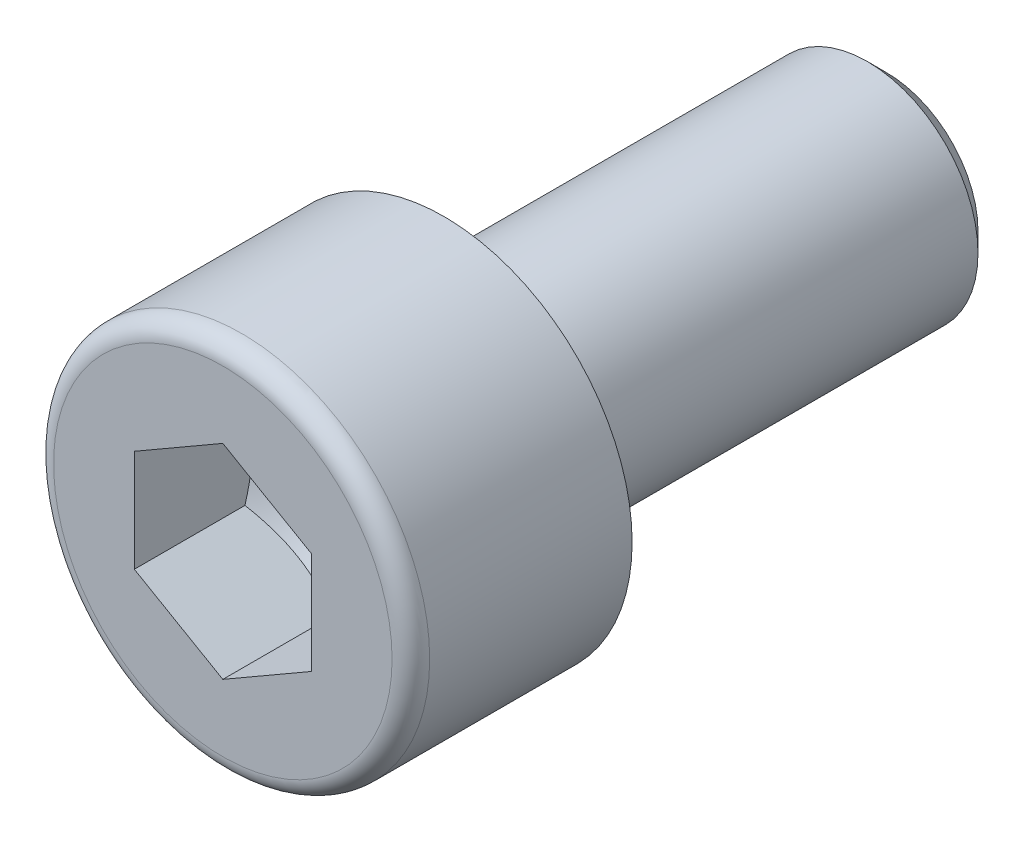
ISO-10303-21;
HEADER;
FILE_DESCRIPTION(('STEP AP214'),'2;1');
FILE_NAME('part.step','',(''),(''),'','','');
FILE_SCHEMA(('AUTOMOTIVE_DESIGN { 1 0 10303 214 1 1 1 1 }'));
ENDSEC;
DATA;
#1=APPLICATION_CONTEXT('core data for automotive mechanical design processes');
#2=APPLICATION_PROTOCOL_DEFINITION('international standard','automotive_design',2000,#1);
#3=PRODUCT_CONTEXT('',#1,'mechanical');
#4=PRODUCT('Part','Part','',(#3));
#5=PRODUCT_RELATED_PRODUCT_CATEGORY('part','',(#4));
#6=PRODUCT_DEFINITION_FORMATION('','',#4);
#7=PRODUCT_DEFINITION_CONTEXT('part definition',#1,'design');
#8=PRODUCT_DEFINITION('design','',#6,#7);
#9=PRODUCT_DEFINITION_SHAPE('','',#8);
#10=(LENGTH_UNIT() NAMED_UNIT(*) SI_UNIT(.MILLI.,.METRE.));
#11=(NAMED_UNIT(*) PLANE_ANGLE_UNIT() SI_UNIT($,.RADIAN.));
#12=(NAMED_UNIT(*) SI_UNIT($,.STERADIAN.) SOLID_ANGLE_UNIT());
#13=UNCERTAINTY_MEASURE_WITH_UNIT(LENGTH_MEASURE(1.E-05),#10,'distance_accuracy_value','');
#14=(GEOMETRIC_REPRESENTATION_CONTEXT(3) GLOBAL_UNCERTAINTY_ASSIGNED_CONTEXT((#13)) GLOBAL_UNIT_ASSIGNED_CONTEXT((#10,
#11,#12)) REPRESENTATION_CONTEXT('',''));
#15=CARTESIAN_POINT('',(0.,0.,0.));
#16=DIRECTION('',(0.,0.,1.));
#17=DIRECTION('',(1.,0.,0.));
#18=AXIS2_PLACEMENT_3D('',#15,#16,#17);
#19=CARTESIAN_POINT('',(0.,0.,5.));
#20=DIRECTION('',(0.,0.,1.));
#21=DIRECTION('',(1.,0.,0.));
#22=AXIS2_PLACEMENT_3D('',#19,#20,#21);
#23=PLANE('',#22);
#24=CARTESIAN_POINT('',(0.,0.,5.));
#25=DIRECTION('',(0.,0.,1.));
#26=DIRECTION('',(1.,0.,0.));
#27=AXIS2_PLACEMENT_3D('',#24,#25,#26);
#28=CIRCLE('',#27,3.825);
#29=CARTESIAN_POINT('',(3.825,0.,5.));
#30=VERTEX_POINT('',#29);
#31=EDGE_CURVE('E10',#30,#30,#28,.T.);
#32=ORIENTED_EDGE('',*,*,#31,.T.);
#33=EDGE_LOOP('',(#32));
#34=FACE_BOUND('',#33,.T.);
#35=DIRECTION('',(0.,-1.,0.));
#36=VECTOR('',#35,1.);
#37=CARTESIAN_POINT('',(1.99999906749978,1.1547,5.));
#38=LINE('',#37,#36);
#39=CARTESIAN_POINT('',(1.99999906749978,1.1547,5.));
#40=VERTEX_POINT('',#39);
#41=CARTESIAN_POINT('',(1.99999906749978,-1.1547,5.));
#42=VERTEX_POINT('',#41);
#43=EDGE_CURVE('E91',#40,#42,#38,.T.);
#44=ORIENTED_EDGE('',*,*,#43,.T.);
#45=DIRECTION('',(-0.866025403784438,-0.5,0.));
#46=VECTOR('',#45,1.);
#47=CARTESIAN_POINT('',(1.99999906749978,-1.1547,5.));
#48=LINE('',#47,#46);
#49=CARTESIAN_POINT('',(0.,-2.3094,5.));
#50=VERTEX_POINT('',#49);
#51=EDGE_CURVE('E30',#42,#50,#48,.T.);
#52=ORIENTED_EDGE('',*,*,#51,.T.);
#53=DIRECTION('',(-0.866025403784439,0.5,0.));
#54=VECTOR('',#53,1.);
#55=CARTESIAN_POINT('',(0.,-2.3094,5.));
#56=LINE('',#55,#54);
#57=CARTESIAN_POINT('',(-1.99999906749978,-1.1547,5.));
#58=VERTEX_POINT('',#57);
#59=EDGE_CURVE('E168',#50,#58,#56,.T.);
#60=ORIENTED_EDGE('',*,*,#59,.T.);
#61=DIRECTION('',(0.,1.,0.));
#62=VECTOR('',#61,1.);
#63=CARTESIAN_POINT('',(-1.99999906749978,-1.1547,5.));
#64=LINE('',#63,#62);
#65=CARTESIAN_POINT('',(-1.99999906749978,1.1547,5.));
#66=VERTEX_POINT('',#65);
#67=EDGE_CURVE('E164',#58,#66,#64,.T.);
#68=ORIENTED_EDGE('',*,*,#67,.T.);
#69=DIRECTION('',(0.866025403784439,0.5,0.));
#70=VECTOR('',#69,1.);
#71=CARTESIAN_POINT('',(-1.99999906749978,1.1547,5.));
#72=LINE('',#71,#70);
#73=CARTESIAN_POINT('',(0.,2.3094,5.));
#74=VERTEX_POINT('',#73);
#75=EDGE_CURVE('E159',#66,#74,#72,.T.);
#76=ORIENTED_EDGE('',*,*,#75,.T.);
#77=DIRECTION('',(0.866025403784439,-0.5,0.));
#78=VECTOR('',#77,1.);
#79=CARTESIAN_POINT('',(0.,2.3094,5.));
#80=LINE('',#79,#78);
#81=EDGE_CURVE('E95',#74,#40,#80,.T.);
#82=ORIENTED_EDGE('',*,*,#81,.T.);
#83=EDGE_LOOP('',(#44,#52,#60,#68,#76,#82));
#84=FACE_BOUND('',#83,.T.);
#85=ADVANCED_FACE('F16',(#34,#84),#23,.T.);
#86=CARTESIAN_POINT('',(0.,0.,4.575));
#87=DIRECTION('',(0.,0.,1.));
#88=DIRECTION('',(1.,0.,0.));
#89=AXIS2_PLACEMENT_3D('',#86,#87,#88);
#90=TOROIDAL_SURFACE('',#89,3.825,0.425);
#91=ORIENTED_EDGE('',*,*,#31,.F.);
#92=EDGE_LOOP('',(#91));
#93=FACE_BOUND('',#92,.T.);
#94=CARTESIAN_POINT('',(0.,0.,4.575));
#95=DIRECTION('',(0.,0.,1.));
#96=DIRECTION('',(1.,0.,0.));
#97=AXIS2_PLACEMENT_3D('',#94,#95,#96);
#98=CIRCLE('',#97,4.25);
#99=CARTESIAN_POINT('',(4.25,0.,4.575));
#100=VERTEX_POINT('',#99);
#101=EDGE_CURVE('E23',#100,#100,#98,.T.);
#102=ORIENTED_EDGE('',*,*,#101,.T.);
#103=EDGE_LOOP('',(#102));
#104=FACE_BOUND('',#103,.T.);
#105=ADVANCED_FACE('F132',(#93,#104),#90,.T.);
#106=CARTESIAN_POINT('',(0.,0.,5.));
#107=DIRECTION('',(0.,0.,1.));
#108=DIRECTION('',(1.,0.,0.));
#109=AXIS2_PLACEMENT_3D('',#106,#107,#108);
#110=CYLINDRICAL_SURFACE('',#109,4.25);
#111=CARTESIAN_POINT('',(0.,0.,0.));
#112=DIRECTION('',(0.,0.,1.));
#113=DIRECTION('',(1.,0.,0.));
#114=AXIS2_PLACEMENT_3D('',#111,#112,#113);
#115=CIRCLE('',#114,4.25);
#116=CARTESIAN_POINT('',(4.25,0.,0.));
#117=VERTEX_POINT('',#116);
#118=EDGE_CURVE('E127',#117,#117,#115,.T.);
#119=ORIENTED_EDGE('',*,*,#118,.T.);
#120=EDGE_LOOP('',(#119));
#121=FACE_BOUND('',#120,.T.);
#122=ORIENTED_EDGE('',*,*,#101,.F.);
#123=EDGE_LOOP('',(#122));
#124=FACE_BOUND('',#123,.T.);
#125=ADVANCED_FACE('F134',(#121,#124),#110,.T.);
#126=CARTESIAN_POINT('',(0.,4.25,0.));
#127=DIRECTION('',(0.,0.,-1.));
#128=DIRECTION('',(-1.,0.,0.));
#129=AXIS2_PLACEMENT_3D('',#126,#127,#128);
#130=PLANE('',#129);
#131=CARTESIAN_POINT('',(0.,0.,0.));
#132=DIRECTION('',(0.,0.,1.));
#133=DIRECTION('',(1.,0.,0.));
#134=AXIS2_PLACEMENT_3D('',#131,#132,#133);
#135=CIRCLE('',#134,2.75);
#136=CARTESIAN_POINT('',(2.75,0.,0.));
#137=VERTEX_POINT('',#136);
#138=EDGE_CURVE('E124',#137,#137,#135,.T.);
#139=ORIENTED_EDGE('',*,*,#138,.T.);
#140=EDGE_LOOP('',(#139));
#141=FACE_BOUND('',#140,.T.);
#142=ORIENTED_EDGE('',*,*,#118,.F.);
#143=EDGE_LOOP('',(#142));
#144=FACE_BOUND('',#143,.T.);
#145=ADVANCED_FACE('F136',(#141,#144),#130,.T.);
#146=CARTESIAN_POINT('',(0.,0.,-0.25));
#147=DIRECTION('',(0.,0.,1.));
#148=DIRECTION('',(1.,0.,0.));
#149=AXIS2_PLACEMENT_3D('',#146,#147,#148);
#150=TOROIDAL_SURFACE('',#149,2.75,0.25);
#151=CARTESIAN_POINT('',(0.,0.,-0.25));
#152=DIRECTION('',(0.,0.,1.));
#153=DIRECTION('',(1.,0.,0.));
#154=AXIS2_PLACEMENT_3D('',#151,#152,#153);
#155=CIRCLE('',#154,2.5);
#156=CARTESIAN_POINT('',(2.5,0.,-0.25));
#157=VERTEX_POINT('',#156);
#158=EDGE_CURVE('E121',#157,#157,#155,.T.);
#159=ORIENTED_EDGE('',*,*,#158,.T.);
#160=EDGE_LOOP('',(#159));
#161=FACE_BOUND('',#160,.T.);
#162=ORIENTED_EDGE('',*,*,#138,.F.);
#163=EDGE_LOOP('',(#162));
#164=FACE_BOUND('',#163,.T.);
#165=ADVANCED_FACE('F144',(#161,#164),#150,.F.);
#166=CARTESIAN_POINT('',(0.,0.,5.));
#167=DIRECTION('',(0.,0.,1.));
#168=DIRECTION('',(1.,0.,0.));
#169=AXIS2_PLACEMENT_3D('',#166,#167,#168);
#170=CYLINDRICAL_SURFACE('',#169,2.5);
#171=CARTESIAN_POINT('',(0.,0.,-0.251));
#172=DIRECTION('',(0.,0.,1.));
#173=DIRECTION('',(1.,0.,0.));
#174=AXIS2_PLACEMENT_3D('',#171,#172,#173);
#175=CIRCLE('',#174,2.5);
#176=CARTESIAN_POINT('',(2.5,0.,-0.251));
#177=VERTEX_POINT('',#176);
#178=EDGE_CURVE('E118',#177,#177,#175,.T.);
#179=ORIENTED_EDGE('',*,*,#178,.T.);
#180=EDGE_LOOP('',(#179));
#181=FACE_BOUND('',#180,.T.);
#182=ORIENTED_EDGE('',*,*,#158,.F.);
#183=EDGE_LOOP('',(#182));
#184=FACE_BOUND('',#183,.T.);
#185=ADVANCED_FACE('F311',(#181,#184),#170,.T.);
#186=CARTESIAN_POINT('',(0.,0.,-0.251));
#187=DIRECTION('',(0.,0.,1.));
#188=DIRECTION('',(1.,0.,0.));
#189=AXIS2_PLACEMENT_3D('',#186,#187,#188);
#190=CONICAL_SURFACE('',#189,2.5,0.524755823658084);
#191=CARTESIAN_POINT('',(0.,0.,-0.998977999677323));
#192=DIRECTION('',(0.,0.,1.));
#193=DIRECTION('',(1.,0.,0.));
#194=AXIS2_PLACEMENT_3D('',#191,#192,#193);
#195=CIRCLE('',#194,2.067);
#196=CARTESIAN_POINT('',(2.067,0.,-0.998977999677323));
#197=VERTEX_POINT('',#196);
#198=EDGE_CURVE('E115',#197,#197,#195,.T.);
#199=ORIENTED_EDGE('',*,*,#198,.T.);
#200=EDGE_LOOP('',(#199));
#201=FACE_BOUND('',#200,.T.);
#202=ORIENTED_EDGE('',*,*,#178,.F.);
#203=EDGE_LOOP('',(#202));
#204=FACE_BOUND('',#203,.T.);
#205=ADVANCED_FACE('F303',(#201,#204),#190,.T.);
#206=CARTESIAN_POINT('',(0.,2.067,-0.998977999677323));
#207=DIRECTION('',(0.,0.,1.));
#208=DIRECTION('',(1.,0.,0.));
#209=AXIS2_PLACEMENT_3D('',#206,#207,#208);
#210=PLANE('',#209);
#211=CARTESIAN_POINT('',(0.,0.,-0.998977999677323));
#212=DIRECTION('',(0.,0.,1.));
#213=DIRECTION('',(1.,0.,0.));
#214=AXIS2_PLACEMENT_3D('',#211,#212,#213);
#215=CIRCLE('',#214,2.5);
#216=CARTESIAN_POINT('',(2.5,0.,-0.998977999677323));
#217=VERTEX_POINT('',#216);
#218=EDGE_CURVE('E112',#217,#217,#215,.T.);
#219=ORIENTED_EDGE('',*,*,#218,.T.);
#220=EDGE_LOOP('',(#219));
#221=FACE_BOUND('',#220,.T.);
#222=ORIENTED_EDGE('',*,*,#198,.F.);
#223=EDGE_LOOP('',(#222));
#224=FACE_BOUND('',#223,.T.);
#225=ADVANCED_FACE('F295',(#221,#224),#210,.T.);
#226=CARTESIAN_POINT('',(0.,0.,5.));
#227=DIRECTION('',(0.,0.,1.));
#228=DIRECTION('',(1.,0.,0.));
#229=AXIS2_PLACEMENT_3D('',#226,#227,#228);
#230=CYLINDRICAL_SURFACE('',#229,2.5);
#231=CARTESIAN_POINT('',(0.,0.,-9.567));
#232=DIRECTION('',(0.,0.,1.));
#233=DIRECTION('',(1.,0.,0.));
#234=AXIS2_PLACEMENT_3D('',#231,#232,#233);
#235=CIRCLE('',#234,2.5);
#236=CARTESIAN_POINT('',(2.5,0.,-9.567));
#237=VERTEX_POINT('',#236);
#238=EDGE_CURVE('E109',#237,#237,#235,.T.);
#239=ORIENTED_EDGE('',*,*,#238,.T.);
#240=EDGE_LOOP('',(#239));
#241=FACE_BOUND('',#240,.T.);
#242=ORIENTED_EDGE('',*,*,#218,.F.);
#243=EDGE_LOOP('',(#242));
#244=FACE_BOUND('',#243,.T.);
#245=ADVANCED_FACE('F287',(#241,#244),#230,.T.);
#246=CARTESIAN_POINT('',(0.,0.,-9.567));
#247=DIRECTION('',(0.,0.,1.));
#248=DIRECTION('',(1.,0.,0.));
#249=AXIS2_PLACEMENT_3D('',#246,#247,#248);
#250=CONICAL_SURFACE('',#249,2.5,0.785398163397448);
#251=CARTESIAN_POINT('',(0.,0.,-10.));
#252=DIRECTION('',(0.,0.,1.));
#253=DIRECTION('',(1.,0.,0.));
#254=AXIS2_PLACEMENT_3D('',#251,#252,#253);
#255=CIRCLE('',#254,2.067);
#256=CARTESIAN_POINT('',(2.067,0.,-10.));
#257=VERTEX_POINT('',#256);
#258=EDGE_CURVE('E106',#257,#257,#255,.T.);
#259=ORIENTED_EDGE('',*,*,#258,.T.);
#260=EDGE_LOOP('',(#259));
#261=FACE_BOUND('',#260,.T.);
#262=ORIENTED_EDGE('',*,*,#238,.F.);
#263=EDGE_LOOP('',(#262));
#264=FACE_BOUND('',#263,.T.);
#265=ADVANCED_FACE('F280',(#261,#264),#250,.T.);
#266=CARTESIAN_POINT('',(0.,2.067,-10.));
#267=DIRECTION('',(0.,0.,-1.));
#268=DIRECTION('',(-1.,0.,0.));
#269=AXIS2_PLACEMENT_3D('',#266,#267,#268);
#270=PLANE('',#269);
#271=ORIENTED_EDGE('',*,*,#258,.F.);
#272=EDGE_LOOP('',(#271));
#273=FACE_BOUND('',#272,.T.);
#274=ADVANCED_FACE('F224',(#273),#270,.T.);
#275=CARTESIAN_POINT('',(1.99999906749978,-1.1547,1.16666728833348));
#276=DIRECTION('',(-0.5,0.866025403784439,0.));
#277=DIRECTION('',(0.866025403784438,0.5,0.));
#278=AXIS2_PLACEMENT_3D('',#275,#276,#277);
#279=PLANE('',#278);
#280=DIRECTION('',(0.,0.,1.));
#281=VECTOR('',#280,1.);
#282=CARTESIAN_POINT('',(0.,-2.3094,1.16666728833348));
#283=LINE('',#282,#281);
#284=CARTESIAN_POINT('',(0.,-2.3094,2.5));
#285=VERTEX_POINT('',#284);
#286=EDGE_CURVE('E104',#285,#50,#283,.T.);
#287=ORIENTED_EDGE('',*,*,#286,.T.);
#288=ORIENTED_EDGE('',*,*,#51,.F.);
#289=DIRECTION('',(0.,0.,1.));
#290=VECTOR('',#289,1.);
#291=CARTESIAN_POINT('',(1.99999906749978,-1.1547,1.16666728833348));
#292=LINE('',#291,#290);
#293=CARTESIAN_POINT('',(1.99999906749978,-1.1547,2.5));
#294=VERTEX_POINT('',#293);
#295=EDGE_CURVE('E85',#294,#42,#292,.T.);
#296=ORIENTED_EDGE('',*,*,#295,.F.);
#297=CARTESIAN_POINT('',(-1.99999999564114E-07,-2.30940011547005,2.50000006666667));
#298=CARTESIAN_POINT('',(0.0878876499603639,-2.25865804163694,2.47069561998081));
#299=CARTESIAN_POINT('',(0.176534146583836,-2.20747796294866,2.44404475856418));
#300=CARTESIAN_POINT('',(0.355361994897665,-2.10423165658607,2.39752647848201));
#301=CARTESIAN_POINT('',(0.445546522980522,-2.0521635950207,2.37767551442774));
#302=CARTESIAN_POINT('',(0.624797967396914,-1.94867272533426,2.34677605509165));
#303=CARTESIAN_POINT('',(0.713837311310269,-1.89726583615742,2.33552188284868));
#304=CARTESIAN_POINT('',(0.892334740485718,-1.79421029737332,2.32208925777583));
#305=CARTESIAN_POINT('',(0.981792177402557,-1.74256202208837,2.31989967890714));
#306=CARTESIAN_POINT('',(1.14893382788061,-1.64606274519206,2.32446636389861));
#307=CARTESIAN_POINT('',(1.2266431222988,-1.60119726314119,2.33010135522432));
#308=CARTESIAN_POINT('',(1.38155546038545,-1.51175858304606,2.34795736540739));
#309=CARTESIAN_POINT('',(1.45875796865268,-1.46718569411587,2.36018447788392));
#310=CARTESIAN_POINT('',(1.61398944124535,-1.37756276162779,2.39074989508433));
#311=CARTESIAN_POINT('',(1.69199876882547,-1.3325240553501,2.40921770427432));
#312=CARTESIAN_POINT('',(1.84685425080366,-1.2431182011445,2.45113182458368));
#313=CARTESIAN_POINT('',(1.92370238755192,-1.19874990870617,2.47456829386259));
#314=CARTESIAN_POINT('',(1.99999926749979,-1.15469988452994,2.50000006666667));
#315=B_SPLINE_CURVE_WITH_KNOTS('',3,(#297,#298,#299,#300,#301,#302,#303,#304,#305,#306,#307,
#308,#309,#310,#311,#312,#313,#314),.UNSPECIFIED.,.F.,.F.,(4,2,2,2,2,2,2,2,4),(0.,
0.317015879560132,0.634793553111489,0.944707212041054,1.25424036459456,1.52370723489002,
1.79342362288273,2.06912103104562,2.3442773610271),.UNSPECIFIED.);
#316=EDGE_CURVE('E78',#285,#294,#315,.T.);
#317=ORIENTED_EDGE('',*,*,#316,.F.);
#318=EDGE_LOOP('',(#287,#288,#296,#317));
#319=FACE_BOUND('',#318,.T.);
#320=ADVANCED_FACE('F86',(#319),#279,.T.);
#321=CARTESIAN_POINT('',(0.,-2.3094,1.16666728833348));
#322=DIRECTION('',(0.5,0.866025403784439,0.));
#323=DIRECTION('',(0.866025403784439,-0.5,0.));
#324=AXIS2_PLACEMENT_3D('',#321,#322,#323);
#325=PLANE('',#324);
#326=DIRECTION('',(0.,0.,1.));
#327=VECTOR('',#326,1.);
#328=CARTESIAN_POINT('',(-1.99999906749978,-1.1547,1.16666728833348));
#329=LINE('',#328,#327);
#330=CARTESIAN_POINT('',(-1.99999906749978,-1.1547,2.5));
#331=VERTEX_POINT('',#330);
#332=EDGE_CURVE('E102',#331,#58,#329,.T.);
#333=ORIENTED_EDGE('',*,*,#332,.T.);
#334=ORIENTED_EDGE('',*,*,#59,.F.);
#335=ORIENTED_EDGE('',*,*,#286,.F.);
#336=CARTESIAN_POINT('',(-1.99999926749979,-1.15469988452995,2.50000006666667));
#337=CARTESIAN_POINT('',(-1.91211141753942,-1.20544195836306,2.47069561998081));
#338=CARTESIAN_POINT('',(-1.82346492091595,-1.25662203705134,2.44404475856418));
#339=CARTESIAN_POINT('',(-1.64463707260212,-1.35986834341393,2.39752647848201));
#340=CARTESIAN_POINT('',(-1.55445254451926,-1.41193640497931,2.37767551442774));
#341=CARTESIAN_POINT('',(-1.37520110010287,-1.51542727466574,2.34677605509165));
#342=CARTESIAN_POINT('',(-1.28616175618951,-1.56683416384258,2.33552188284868));
#343=CARTESIAN_POINT('',(-1.10766432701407,-1.66988970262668,2.32208925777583));
#344=CARTESIAN_POINT('',(-1.01820689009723,-1.72153797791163,2.31989967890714));
#345=CARTESIAN_POINT('',(-0.851065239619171,-1.81803725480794,2.32446636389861));
#346=CARTESIAN_POINT('',(-0.773355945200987,-1.86290273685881,2.33010135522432));
#347=CARTESIAN_POINT('',(-0.618443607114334,-1.95234141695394,2.34795736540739));
#348=CARTESIAN_POINT('',(-0.541241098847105,-1.99691430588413,2.36018447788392));
#349=CARTESIAN_POINT('',(-0.386009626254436,-2.08653723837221,2.39074989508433));
#350=CARTESIAN_POINT('',(-0.30800029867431,-2.1315759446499,2.40921770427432));
#351=CARTESIAN_POINT('',(-0.153144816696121,-2.2209817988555,2.45113182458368));
#352=CARTESIAN_POINT('',(-0.0762966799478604,-2.26535009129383,2.47456829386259));
#353=CARTESIAN_POINT('',(2.00000000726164E-07,-2.30940011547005,2.50000006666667));
#354=B_SPLINE_CURVE_WITH_KNOTS('',3,(#336,#337,#338,#339,#340,#341,#342,#343,#344,#345,#346,
#347,#348,#349,#350,#351,#352,#353),.UNSPECIFIED.,.F.,.F.,(4,2,2,2,2,2,2,2,4),(0.,
0.317015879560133,0.63479355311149,0.944707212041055,1.25424036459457,1.52370723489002,
1.79342362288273,2.06912103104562,2.3442773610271),.UNSPECIFIED.);
#355=EDGE_CURVE('E82',#331,#285,#354,.T.);
#356=ORIENTED_EDGE('',*,*,#355,.F.);
#357=EDGE_LOOP('',(#333,#334,#335,#356));
#358=FACE_BOUND('',#357,.T.);
#359=ADVANCED_FACE('F215',(#358),#325,.T.);
#360=CARTESIAN_POINT('',(-1.99999906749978,-1.1547,1.16666728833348));
#361=DIRECTION('',(1.,0.,0.));
#362=DIRECTION('',(0.,-1.,0.));
#363=AXIS2_PLACEMENT_3D('',#360,#361,#362);
#364=PLANE('',#363);
#365=DIRECTION('',(0.,0.,1.));
#366=VECTOR('',#365,1.);
#367=CARTESIAN_POINT('',(-1.99999906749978,1.1547,1.16666728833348));
#368=LINE('',#367,#366);
#369=CARTESIAN_POINT('',(-1.99999906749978,1.1547,2.5));
#370=VERTEX_POINT('',#369);
#371=EDGE_CURVE('E100',#370,#66,#368,.T.);
#372=ORIENTED_EDGE('',*,*,#371,.T.);
#373=ORIENTED_EDGE('',*,*,#67,.F.);
#374=ORIENTED_EDGE('',*,*,#332,.F.);
#375=CARTESIAN_POINT('',(-1.99999906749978,-2.99028884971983,3.24367023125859));
#376=CARTESIAN_POINT('',(-1.99999906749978,-2.90392200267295,3.20223468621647));
#377=CARTESIAN_POINT('',(-1.99999906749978,-2.81734475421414,3.16122952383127));
#378=CARTESIAN_POINT('',(-1.99999906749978,-2.64365731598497,3.08032411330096));
#379=CARTESIAN_POINT('',(-1.99999906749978,-2.55654703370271,3.04042406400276));
#380=CARTESIAN_POINT('',(-1.99999906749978,-2.38118192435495,2.96175012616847));
#381=CARTESIAN_POINT('',(-1.99999906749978,-2.29292335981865,2.92298453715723));
#382=CARTESIAN_POINT('',(-1.99999906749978,-2.11566562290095,2.84719170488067));
#383=CARTESIAN_POINT('',(-1.99999906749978,-2.02666648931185,2.81016437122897));
#384=CARTESIAN_POINT('',(-1.99999906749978,-1.84544164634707,2.73736806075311));
#385=CARTESIAN_POINT('',(-1.99999906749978,-1.75319241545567,2.70165729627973));
#386=CARTESIAN_POINT('',(-1.99999906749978,-1.56757813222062,2.63320478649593));
#387=CARTESIAN_POINT('',(-1.99999906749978,-1.47421295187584,2.60046338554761));
#388=CARTESIAN_POINT('',(-1.99999906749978,-1.28643386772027,2.53888591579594));
#389=CARTESIAN_POINT('',(-1.99999906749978,-1.19202295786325,2.51004081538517));
#390=CARTESIAN_POINT('',(-1.99999906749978,-1.00184812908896,2.45724234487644));
#391=CARTESIAN_POINT('',(-1.99999906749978,-0.906084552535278,2.43328775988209));
#392=CARTESIAN_POINT('',(-1.99999906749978,-0.713403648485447,2.39154750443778));
#393=CARTESIAN_POINT('',(-1.99999906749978,-0.616489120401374,2.37374916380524));
#394=CARTESIAN_POINT('',(-1.99999906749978,-0.42157646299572,2.34548602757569));
#395=CARTESIAN_POINT('',(-1.99999906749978,-0.323578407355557,2.33502073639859));
#396=CARTESIAN_POINT('',(-1.99999906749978,-0.128212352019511,2.32239776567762));
#397=CARTESIAN_POINT('',(-1.99999906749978,-0.030850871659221,2.32014205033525));
#398=CARTESIAN_POINT('',(-1.99999906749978,0.163710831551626,2.32386608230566));
#399=CARTESIAN_POINT('',(-1.99999906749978,0.26091104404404,2.32984633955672));
#400=CARTESIAN_POINT('',(-1.99999906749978,0.500738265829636,2.35423686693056));
#401=CARTESIAN_POINT('',(-1.99999906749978,0.64290057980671,2.3772180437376));
#402=CARTESIAN_POINT('',(-1.99999906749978,0.924460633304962,2.43647980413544));
#403=CARTESIAN_POINT('',(-1.99999906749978,1.06385482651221,2.47277641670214));
#404=CARTESIAN_POINT('',(-1.99999906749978,1.27233418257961,2.53477991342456));
#405=CARTESIAN_POINT('',(-1.99999906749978,1.3424969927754,2.55699669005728));
#406=CARTESIAN_POINT('',(-1.99999906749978,1.4820922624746,2.60348542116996));
#407=CARTESIAN_POINT('',(-1.99999906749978,1.55152514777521,2.62775609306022));
#408=CARTESIAN_POINT('',(-1.99999906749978,1.68975335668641,2.67800013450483));
#409=CARTESIAN_POINT('',(-1.99999906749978,1.75854879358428,2.7039731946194));
#410=CARTESIAN_POINT('',(-1.99999906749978,1.8955975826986,2.75734107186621));
#411=CARTESIAN_POINT('',(-1.99999906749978,1.96385084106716,2.78473612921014));
#412=CARTESIAN_POINT('',(-1.99999906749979,2.13806939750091,2.8564177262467));
#413=CARTESIAN_POINT('',(-1.99999906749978,2.24368634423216,2.90155001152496));
#414=CARTESIAN_POINT('',(-1.99999906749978,2.45396648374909,2.99399021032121));
#415=CARTESIAN_POINT('',(-1.99999906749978,2.55862960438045,3.04129828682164));
#416=CARTESIAN_POINT('',(-1.99999906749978,2.87150603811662,3.18571921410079));
#417=CARTESIAN_POINT('',(-1.99999906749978,3.07857147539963,3.28531395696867));
#418=CARTESIAN_POINT('',(-1.99999906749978,3.49093332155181,3.4886804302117));
#419=CARTESIAN_POINT('',(-1.99999906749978,3.69622724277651,3.59245714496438));
#420=CARTESIAN_POINT('',(-1.99999906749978,4.10540852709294,3.80267901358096));
#421=CARTESIAN_POINT('',(-1.99999906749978,4.30929606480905,3.90912382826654));
#422=CARTESIAN_POINT('',(-1.99999906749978,4.69689950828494,4.11371795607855));
#423=CARTESIAN_POINT('',(-1.99999906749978,4.8807029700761,4.21170196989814));
#424=CARTESIAN_POINT('',(-1.99999906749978,5.24771864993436,4.40878643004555));
#425=CARTESIAN_POINT('',(-1.99999906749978,5.43093084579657,4.50788691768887));
#426=CARTESIAN_POINT('',(-1.99999906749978,5.79643429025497,4.70667121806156));
#427=CARTESIAN_POINT('',(-1.99999906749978,5.97872669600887,4.80635290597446));
#428=CARTESIAN_POINT('',(-1.99999906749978,6.34294295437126,5.00636506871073));
#429=CARTESIAN_POINT('',(-1.99999906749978,6.52486682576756,5.10669550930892));
#430=CARTESIAN_POINT('',(-1.99999906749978,6.70665829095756,5.20726384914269));
#431=B_SPLINE_CURVE_WITH_KNOTS('',3,(#375,#376,#377,#378,#379,#380,#381,#382,#383,#384,#385,
#386,#387,#388,#389,#390,#391,#392,#393,#394,#395,#396,#397,#398,#399,#400,#401,#402,#403,#404,
#405,#406,#407,#408,#409,#410,#411,#412,#413,#414,#415,#416,#417,#418,#419,#420,#421,#422,#423,
#424,#425,#426,#427,#428,#429,#430),.UNSPECIFIED.,.F.,.F.,(4,2,2,2,2,2,2,2,2,2,2,2,2,2,2,2,2,2,
2,2,2,2,2,2,2,2,2,4),(0.,0.287380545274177,0.574812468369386,0.86398796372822,1.15314840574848,
1.44986914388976,1.746624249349,2.04267922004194,2.33866055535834,2.63402905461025,
2.92937759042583,3.22118738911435,3.51301525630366,3.94415234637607,4.37581014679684,
4.59657452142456,4.81720203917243,5.03778956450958,5.25841447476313,5.6029464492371,
5.94750427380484,6.63673372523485,7.32681046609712,8.01679992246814,8.64166451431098,
9.26655230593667,9.88985069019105,10.5131164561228),.UNSPECIFIED.);
#432=EDGE_CURVE('E206',#370,#331,#431,.F.);
#433=ORIENTED_EDGE('',*,*,#432,.F.);
#434=EDGE_LOOP('',(#372,#373,#374,#433));
#435=FACE_BOUND('',#434,.T.);
#436=ADVANCED_FACE('F211',(#435),#364,.T.);
#437=CARTESIAN_POINT('',(-1.99999906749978,1.1547,1.16666728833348));
#438=DIRECTION('',(0.5,-0.866025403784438,0.));
#439=DIRECTION('',(-0.866025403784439,-0.5,0.));
#440=AXIS2_PLACEMENT_3D('',#437,#438,#439);
#441=PLANE('',#440);
#442=DIRECTION('',(0.,0.,1.));
#443=VECTOR('',#442,1.);
#444=CARTESIAN_POINT('',(0.,2.3094,1.16666728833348));
#445=LINE('',#444,#443);
#446=CARTESIAN_POINT('',(0.,2.3094,2.5));
#447=VERTEX_POINT('',#446);
#448=EDGE_CURVE('E93',#447,#74,#445,.T.);
#449=ORIENTED_EDGE('',*,*,#448,.T.);
#450=ORIENTED_EDGE('',*,*,#75,.F.);
#451=ORIENTED_EDGE('',*,*,#371,.F.);
#452=CARTESIAN_POINT('',(2.00000000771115E-07,2.30940011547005,2.50000006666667));
#453=CARTESIAN_POINT('',(-0.0878876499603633,2.25865804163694,2.47069561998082));
#454=CARTESIAN_POINT('',(-0.176534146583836,2.20747796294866,2.44404475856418));
#455=CARTESIAN_POINT('',(-0.355361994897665,2.10423165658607,2.39752647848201));
#456=CARTESIAN_POINT('',(-0.445546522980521,2.0521635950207,2.37767551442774));
#457=CARTESIAN_POINT('',(-0.624797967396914,1.94867272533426,2.34677605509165));
#458=CARTESIAN_POINT('',(-0.713837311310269,1.89726583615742,2.33552188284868));
#459=CARTESIAN_POINT('',(-0.892334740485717,1.79421029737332,2.32208925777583));
#460=CARTESIAN_POINT('',(-0.981792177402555,1.74256202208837,2.31989967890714));
#461=CARTESIAN_POINT('',(-1.14893382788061,1.64606274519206,2.32446636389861));
#462=CARTESIAN_POINT('',(-1.2266431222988,1.60119726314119,2.33010135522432));
#463=CARTESIAN_POINT('',(-1.38155546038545,1.51175858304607,2.34795736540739));
#464=CARTESIAN_POINT('',(-1.45875796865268,1.46718569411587,2.36018447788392));
#465=CARTESIAN_POINT('',(-1.61398944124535,1.37756276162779,2.39074989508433));
#466=CARTESIAN_POINT('',(-1.69199876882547,1.3325240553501,2.40921770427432));
#467=CARTESIAN_POINT('',(-1.84685425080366,1.2431182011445,2.45113182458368));
#468=CARTESIAN_POINT('',(-1.92370238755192,1.19874990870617,2.47456829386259));
#469=CARTESIAN_POINT('',(-1.99999926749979,1.15469988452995,2.50000006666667));
#470=B_SPLINE_CURVE_WITH_KNOTS('',3,(#452,#453,#454,#455,#456,#457,#458,#459,#460,#461,#462,
#463,#464,#465,#466,#467,#468,#469),.UNSPECIFIED.,.F.,.F.,(4,2,2,2,2,2,2,2,4),(0.,
0.317015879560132,0.634793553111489,0.944707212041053,1.25424036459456,1.52370723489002,
1.79342362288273,2.06912103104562,2.3442773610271),.UNSPECIFIED.);
#471=EDGE_CURVE('E201',#447,#370,#470,.T.);
#472=ORIENTED_EDGE('',*,*,#471,.F.);
#473=EDGE_LOOP('',(#449,#450,#451,#472));
#474=FACE_BOUND('',#473,.T.);
#475=ADVANCED_FACE('F214',(#474),#441,.T.);
#476=CARTESIAN_POINT('',(0.,2.3094,1.16666728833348));
#477=DIRECTION('',(-0.5,-0.866025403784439,0.));
#478=DIRECTION('',(-0.866025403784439,0.5,0.));
#479=AXIS2_PLACEMENT_3D('',#476,#477,#478);
#480=PLANE('',#479);
#481=DIRECTION('',(0.,0.,1.));
#482=VECTOR('',#481,1.);
#483=CARTESIAN_POINT('',(1.99999906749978,1.1547,1.16666728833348));
#484=LINE('',#483,#482);
#485=CARTESIAN_POINT('',(1.99999906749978,1.1547,2.5));
#486=VERTEX_POINT('',#485);
#487=EDGE_CURVE('E90',#486,#40,#484,.T.);
#488=ORIENTED_EDGE('',*,*,#487,.T.);
#489=ORIENTED_EDGE('',*,*,#81,.F.);
#490=ORIENTED_EDGE('',*,*,#448,.F.);
#491=CARTESIAN_POINT('',(1.99999926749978,1.15469988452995,2.50000006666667));
#492=CARTESIAN_POINT('',(1.91211141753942,1.20544195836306,2.47069561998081));
#493=CARTESIAN_POINT('',(1.82346492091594,1.25662203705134,2.44404475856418));
#494=CARTESIAN_POINT('',(1.64463707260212,1.35986834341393,2.39752647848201));
#495=CARTESIAN_POINT('',(1.55445254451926,1.41193640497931,2.37767551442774));
#496=CARTESIAN_POINT('',(1.37520110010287,1.51542727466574,2.34677605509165));
#497=CARTESIAN_POINT('',(1.28616175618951,1.56683416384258,2.33552188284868));
#498=CARTESIAN_POINT('',(1.10766432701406,1.66988970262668,2.32208925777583));
#499=CARTESIAN_POINT('',(1.01820689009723,1.72153797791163,2.31989967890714));
#500=CARTESIAN_POINT('',(0.851065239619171,1.81803725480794,2.32446636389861));
#501=CARTESIAN_POINT('',(0.773355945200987,1.86290273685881,2.33010135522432));
#502=CARTESIAN_POINT('',(0.618443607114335,1.95234141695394,2.34795736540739));
#503=CARTESIAN_POINT('',(0.541241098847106,1.99691430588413,2.36018447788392));
#504=CARTESIAN_POINT('',(0.386009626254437,2.08653723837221,2.39074989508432));
#505=CARTESIAN_POINT('',(0.308000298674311,2.1315759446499,2.40921770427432));
#506=CARTESIAN_POINT('',(0.153144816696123,2.2209817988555,2.45113182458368));
#507=CARTESIAN_POINT('',(0.0762966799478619,2.26535009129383,2.47456829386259));
#508=CARTESIAN_POINT('',(-1.99999999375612E-07,2.30940011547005,2.50000006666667));
#509=B_SPLINE_CURVE_WITH_KNOTS('',3,(#491,#492,#493,#494,#495,#496,#497,#498,#499,#500,#501,
#502,#503,#504,#505,#506,#507,#508),.UNSPECIFIED.,.F.,.F.,(4,2,2,2,2,2,2,2,4),(0.,
0.317015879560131,0.634793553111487,0.944707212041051,1.25424036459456,1.52370723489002,
1.79342362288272,2.06912103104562,2.34427736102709),.UNSPECIFIED.);
#510=EDGE_CURVE('E38',#486,#447,#509,.T.);
#511=ORIENTED_EDGE('',*,*,#510,.F.);
#512=EDGE_LOOP('',(#488,#489,#490,#511));
#513=FACE_BOUND('',#512,.T.);
#514=ADVANCED_FACE('F158',(#513),#480,.T.);
#515=CARTESIAN_POINT('',(1.99999906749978,1.1547,1.16666728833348));
#516=DIRECTION('',(-1.,0.,0.));
#517=DIRECTION('',(0.,1.,0.));
#518=AXIS2_PLACEMENT_3D('',#515,#516,#517);
#519=PLANE('',#518);
#520=ORIENTED_EDGE('',*,*,#295,.T.);
#521=ORIENTED_EDGE('',*,*,#43,.F.);
#522=ORIENTED_EDGE('',*,*,#487,.F.);
#523=CARTESIAN_POINT('',(1.99999906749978,-2.99028884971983,3.24367023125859));
#524=CARTESIAN_POINT('',(1.99999906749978,-2.90392200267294,3.20223468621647));
#525=CARTESIAN_POINT('',(1.99999906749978,-2.81734475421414,3.16122952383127));
#526=CARTESIAN_POINT('',(1.99999906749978,-2.64365731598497,3.08032411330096));
#527=CARTESIAN_POINT('',(1.99999906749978,-2.55654703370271,3.04042406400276));
#528=CARTESIAN_POINT('',(1.99999906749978,-2.38118192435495,2.96175012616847));
#529=CARTESIAN_POINT('',(1.99999906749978,-2.29292335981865,2.92298453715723));
#530=CARTESIAN_POINT('',(1.99999906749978,-2.11566562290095,2.84719170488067));
#531=CARTESIAN_POINT('',(1.99999906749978,-2.02666648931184,2.81016437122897));
#532=CARTESIAN_POINT('',(1.99999906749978,-1.84544164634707,2.73736806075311));
#533=CARTESIAN_POINT('',(1.99999906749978,-1.75319241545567,2.70165729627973));
#534=CARTESIAN_POINT('',(1.99999906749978,-1.56757813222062,2.63320478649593));
#535=CARTESIAN_POINT('',(1.99999906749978,-1.47421295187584,2.60046338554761));
#536=CARTESIAN_POINT('',(1.99999906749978,-1.28643386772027,2.53888591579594));
#537=CARTESIAN_POINT('',(1.99999906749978,-1.19202295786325,2.51004081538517));
#538=CARTESIAN_POINT('',(1.99999906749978,-1.00184812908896,2.45724234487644));
#539=CARTESIAN_POINT('',(1.99999906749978,-0.906084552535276,2.43328775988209));
#540=CARTESIAN_POINT('',(1.99999906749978,-0.713403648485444,2.39154750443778));
#541=CARTESIAN_POINT('',(1.99999906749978,-0.616489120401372,2.37374916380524));
#542=CARTESIAN_POINT('',(1.99999906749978,-0.421576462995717,2.34548602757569));
#543=CARTESIAN_POINT('',(1.99999906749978,-0.323578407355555,2.33502073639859));
#544=CARTESIAN_POINT('',(1.99999906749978,-0.128212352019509,2.32239776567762));
#545=CARTESIAN_POINT('',(1.99999906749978,-0.0308508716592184,2.32014205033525));
#546=CARTESIAN_POINT('',(1.99999906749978,0.163710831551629,2.32386608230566));
#547=CARTESIAN_POINT('',(1.99999906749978,0.260911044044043,2.32984633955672));
#548=CARTESIAN_POINT('',(1.99999906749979,0.500738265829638,2.35423686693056));
#549=CARTESIAN_POINT('',(1.99999906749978,0.642900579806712,2.3772180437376));
#550=CARTESIAN_POINT('',(1.99999906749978,0.924460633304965,2.43647980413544));
#551=CARTESIAN_POINT('',(1.99999906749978,1.06385482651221,2.47277641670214));
#552=CARTESIAN_POINT('',(1.99999906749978,1.27233418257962,2.53477991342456));
#553=CARTESIAN_POINT('',(1.99999906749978,1.34249699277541,2.55699669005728));
#554=CARTESIAN_POINT('',(1.99999906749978,1.4820922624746,2.60348542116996));
#555=CARTESIAN_POINT('',(1.99999906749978,1.55152514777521,2.62775609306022));
#556=CARTESIAN_POINT('',(1.99999906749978,1.68975335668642,2.67800013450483));
#557=CARTESIAN_POINT('',(1.99999906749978,1.75854879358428,2.7039731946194));
#558=CARTESIAN_POINT('',(1.99999906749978,1.8955975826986,2.75734107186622));
#559=CARTESIAN_POINT('',(1.99999906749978,1.96385084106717,2.78473612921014));
#560=CARTESIAN_POINT('',(1.99999906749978,2.13806939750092,2.8564177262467));
#561=CARTESIAN_POINT('',(1.99999906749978,2.24368634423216,2.90155001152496));
#562=CARTESIAN_POINT('',(1.99999906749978,2.45396648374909,2.99399021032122));
#563=CARTESIAN_POINT('',(1.99999906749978,2.55862960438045,3.04129828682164));
#564=CARTESIAN_POINT('',(1.99999906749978,2.87150603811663,3.18571921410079));
#565=CARTESIAN_POINT('',(1.99999906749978,3.07857147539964,3.28531395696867));
#566=CARTESIAN_POINT('',(1.99999906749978,3.49093332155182,3.4886804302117));
#567=CARTESIAN_POINT('',(1.99999906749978,3.69622724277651,3.59245714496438));
#568=CARTESIAN_POINT('',(1.99999906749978,4.10540852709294,3.80267901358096));
#569=CARTESIAN_POINT('',(1.99999906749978,4.30929606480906,3.90912382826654));
#570=CARTESIAN_POINT('',(1.99999906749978,4.69689950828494,4.11371795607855));
#571=CARTESIAN_POINT('',(1.99999906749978,4.88070297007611,4.21170196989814));
#572=CARTESIAN_POINT('',(1.99999906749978,5.24771864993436,4.40878643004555));
#573=CARTESIAN_POINT('',(1.99999906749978,5.43093084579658,4.50788691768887));
#574=CARTESIAN_POINT('',(1.99999906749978,5.79643429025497,4.70667121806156));
#575=CARTESIAN_POINT('',(1.99999906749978,5.97872669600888,4.80635290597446));
#576=CARTESIAN_POINT('',(1.99999906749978,6.34294295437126,5.00636506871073));
#577=CARTESIAN_POINT('',(1.99999906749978,6.52486682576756,5.10669550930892));
#578=CARTESIAN_POINT('',(1.99999906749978,6.70665829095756,5.20726384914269));
#579=B_SPLINE_CURVE_WITH_KNOTS('',3,(#523,#524,#525,#526,#527,#528,#529,#530,#531,#532,#533,
#534,#535,#536,#537,#538,#539,#540,#541,#542,#543,#544,#545,#546,#547,#548,#549,#550,#551,#552,
#553,#554,#555,#556,#557,#558,#559,#560,#561,#562,#563,#564,#565,#566,#567,#568,#569,#570,#571,
#572,#573,#574,#575,#576,#577,#578),.UNSPECIFIED.,.F.,.F.,(4,2,2,2,2,2,2,2,2,2,2,2,2,2,2,2,2,2,
2,2,2,2,2,2,2,2,2,4),(0.,0.287380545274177,0.574812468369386,0.86398796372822,1.15314840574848,
1.44986914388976,1.746624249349,2.04267922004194,2.33866055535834,2.63402905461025,
2.92937759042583,3.22118738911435,3.51301525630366,3.94415234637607,4.37581014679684,
4.59657452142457,4.81720203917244,5.03778956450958,5.25841447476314,5.6029464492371,
5.94750427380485,6.63673372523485,7.32681046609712,8.01679992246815,8.64166451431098,
9.26655230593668,9.88985069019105,10.5131164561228),.UNSPECIFIED.);
#580=EDGE_CURVE('E79',#294,#486,#579,.T.);
#581=ORIENTED_EDGE('',*,*,#580,.F.);
#582=EDGE_LOOP('',(#520,#521,#522,#581));
#583=FACE_BOUND('',#582,.T.);
#584=ADVANCED_FACE('F74',(#583),#519,.T.);
#585=CARTESIAN_POINT('',(0.,0.,1.16666728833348));
#586=DIRECTION('',(0.,0.,1.));
#587=DIRECTION('',(1.,0.,0.));
#588=AXIS2_PLACEMENT_3D('',#585,#586,#587);
#589=CONICAL_SURFACE('',#588,0.,1.0471975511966);
#590=CARTESIAN_POINT('',(0.,0.,1.16666728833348));
#591=VERTEX_POINT('',#590);
#592=VERTEX_LOOP('',#591);
#593=FACE_BOUND('',#592,.T.);
#594=ORIENTED_EDGE('',*,*,#316,.T.);
#595=ORIENTED_EDGE('',*,*,#580,.T.);
#596=ORIENTED_EDGE('',*,*,#510,.T.);
#597=ORIENTED_EDGE('',*,*,#471,.T.);
#598=ORIENTED_EDGE('',*,*,#432,.T.);
#599=ORIENTED_EDGE('',*,*,#355,.T.);
#600=EDGE_LOOP('',(#594,#595,#596,#597,#598,#599));
#601=FACE_BOUND('',#600,.T.);
#602=ADVANCED_FACE('F71',(#593,#601),#589,.F.);
#603=CLOSED_SHELL('',(#85,#105,#125,#145,#165,#185,#205,#225,#245,#265,#274,#320,#359,#436,#475,
#514,#584,#602));
#604=MANIFOLD_SOLID_BREP('B1',#603);
#605=ADVANCED_BREP_SHAPE_REPRESENTATION('',(#18,#604),#14);
#606=SHAPE_DEFINITION_REPRESENTATION(#9,#605);
ENDSEC;
END-ISO-10303-21;
